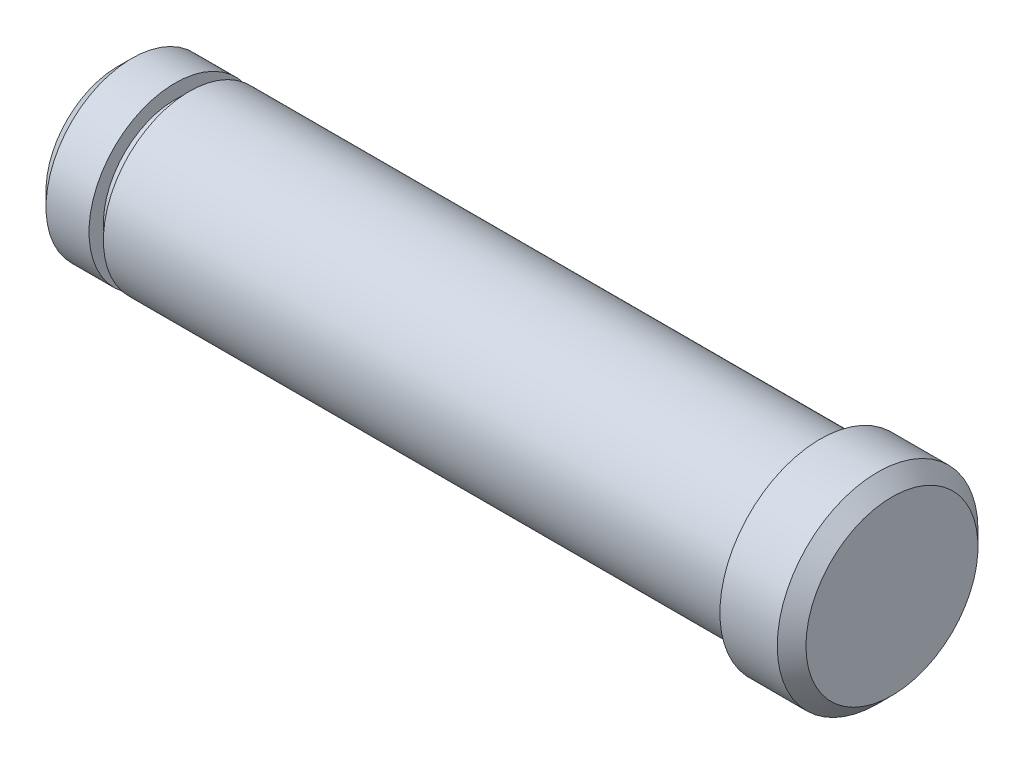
from build123d import *

# Parameters (mm, degrees)
SFAZOWANIE1_SIZE = 1


with BuildPart() as part:
    # Szkic1 → Obr_t1 (revolve)
    with BuildSketch(Plane.XY, mode=Mode.PRIVATE) as obr_t1_sk:
        Polygon((0, 0), (0, 6), (4, 6), (4, 5), (5, 5), (5, 6), (49, 6), (49, 7), (54, 7), (54, 0), align=None)
    revolve(obr_t1_sk.sketch.rotate(Axis((0, 0, 0), (-1, 0, 0)), 90), axis=Axis((0, 0, 0), (-1, 0, 0)))

    # Sfazowanie1
    sfazowanie1_edges = [part.edges().sort_by_distance(p)[0] for p in [
        (54, 0, 7),
        (0, 0, 6),
    ]]
    chamfer(sfazowanie1_edges, length=SFAZOWANIE1_SIZE)


solid = part.part
